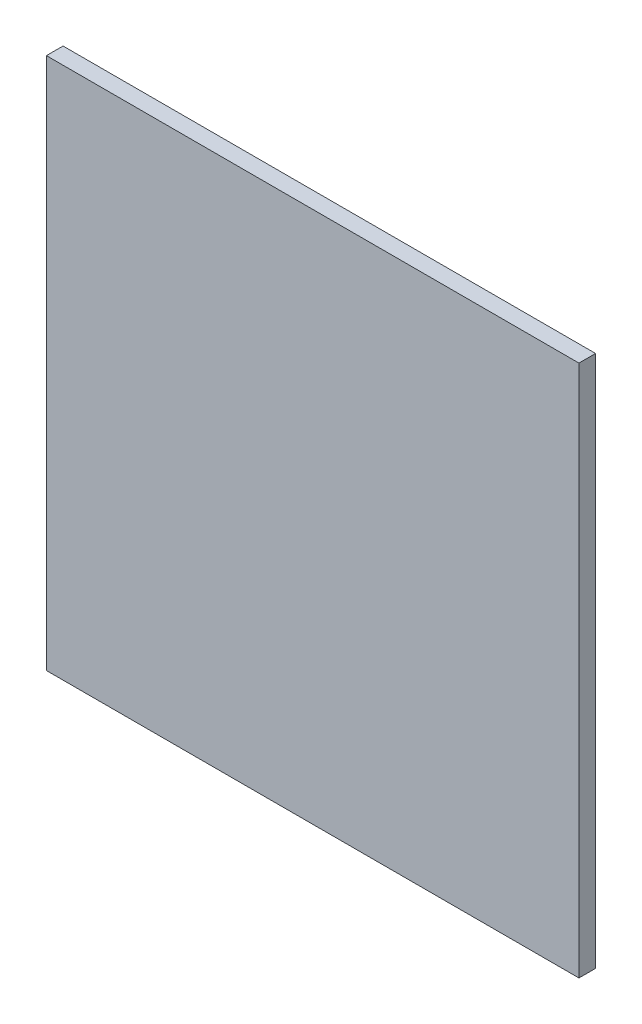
from build123d import *

# Parameters (mm, degrees)
SKETCH2_W           = 203.2
SKETCH2_H           = 203.2
BOSS_EXTRUDE1_DEPTH = 6.35


with BuildPart() as part:
    # Sketch2 → Boss-Extrude1 (new body)
    with BuildSketch(Plane.XY):
        with Locations((101.6, 101.6)):
            Rectangle(SKETCH2_W, SKETCH2_H)
    extrude(amount=BOSS_EXTRUDE1_DEPTH)


solid = part.part
